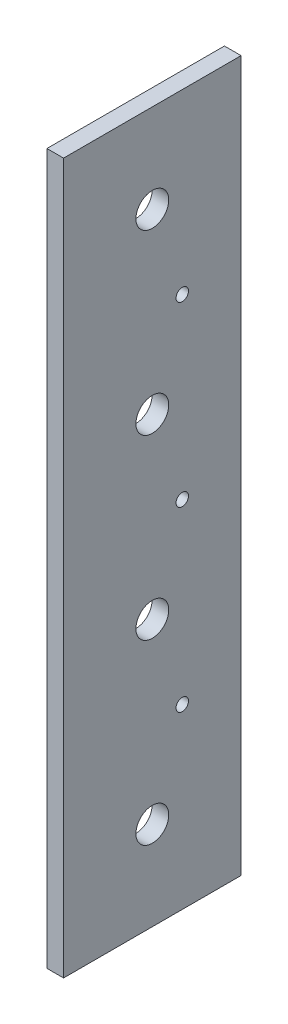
from build123d import *

# Parameters (mm, degrees)
SKETCH1_W           = 50.8
SKETCH1_H           = 203.2
BOSS_EXTRUDE1_DEPTH = 4.7625
SKETCH2_R           = 4.699
SKETCH2_R_2         = 1.778
CUT_EXTRUDE1_DEPTH  = 105.83511533


with BuildPart() as part:
    # Sketch1 → Boss-Extrude1 (new body)
    with BuildSketch(Plane(origin=(0, 0, 0), x_dir=(0, 0, -1), z_dir=(1, 0, 0))):
        Rectangle(SKETCH1_W, SKETCH1_H)
    extrude(amount=BOSS_EXTRUDE1_DEPTH)

    # Sketch2 → Cut-Extrude1 (cut, through all)
    with BuildSketch(Plane.ZY):
        with Locations((0, -76.2)):
            Circle(SKETCH2_R)
        with Locations((0, -25.4)):
            Circle(SKETCH2_R)
        with Locations((0, 25.4)):
            Circle(SKETCH2_R)
        with Locations((0, 76.2)):
            Circle(SKETCH2_R)
        with Locations((-8.5725, -50.8)):
            Circle(SKETCH2_R_2)
        with Locations((-8.5725, 50.8)):
            Circle(SKETCH2_R_2)
        with Locations((-8.5725, 0)):
            Circle(SKETCH2_R_2)
    extrude(amount=-CUT_EXTRUDE1_DEPTH, mode=Mode.SUBTRACT)


solid = part.part
